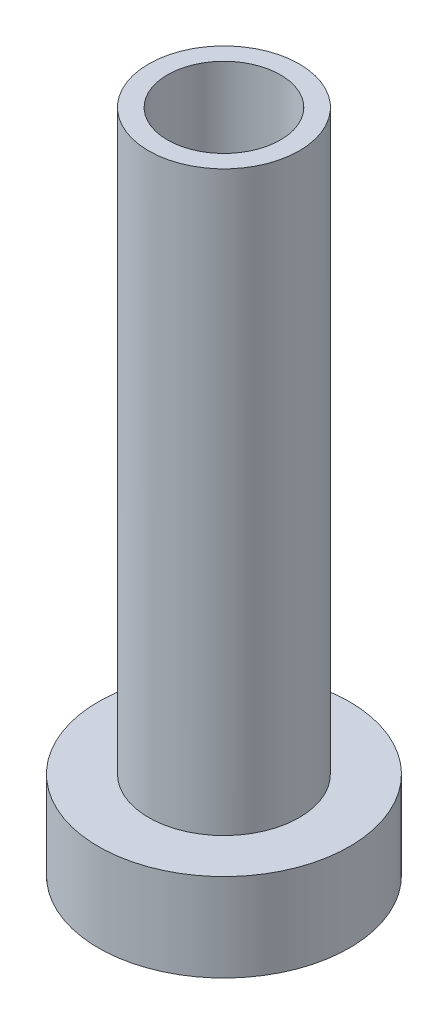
ISO-10303-21;
HEADER;
FILE_DESCRIPTION(('STEP AP214'),'2;1');
FILE_NAME('part.step','',(''),(''),'','','');
FILE_SCHEMA(('AUTOMOTIVE_DESIGN { 1 0 10303 214 1 1 1 1 }'));
ENDSEC;
DATA;
#1=APPLICATION_CONTEXT('core data for automotive mechanical design processes');
#2=APPLICATION_PROTOCOL_DEFINITION('international standard','automotive_design',2000,#1);
#3=PRODUCT_CONTEXT('',#1,'mechanical');
#4=PRODUCT('Part','Part','',(#3));
#5=PRODUCT_RELATED_PRODUCT_CATEGORY('part','',(#4));
#6=PRODUCT_DEFINITION_FORMATION('','',#4);
#7=PRODUCT_DEFINITION_CONTEXT('part definition',#1,'design');
#8=PRODUCT_DEFINITION('design','',#6,#7);
#9=PRODUCT_DEFINITION_SHAPE('','',#8);
#10=(LENGTH_UNIT() NAMED_UNIT(*) SI_UNIT(.MILLI.,.METRE.));
#11=(NAMED_UNIT(*) PLANE_ANGLE_UNIT() SI_UNIT($,.RADIAN.));
#12=(NAMED_UNIT(*) SI_UNIT($,.STERADIAN.) SOLID_ANGLE_UNIT());
#13=UNCERTAINTY_MEASURE_WITH_UNIT(LENGTH_MEASURE(1.E-05),#10,'distance_accuracy_value','');
#14=(GEOMETRIC_REPRESENTATION_CONTEXT(3) GLOBAL_UNCERTAINTY_ASSIGNED_CONTEXT((#13)) GLOBAL_UNIT_ASSIGNED_CONTEXT((#10,
#11,#12)) REPRESENTATION_CONTEXT('',''));
#15=CARTESIAN_POINT('',(0.,0.,0.));
#16=DIRECTION('',(0.,0.,1.));
#17=DIRECTION('',(1.,0.,0.));
#18=AXIS2_PLACEMENT_3D('',#15,#16,#17);
#19=CARTESIAN_POINT('',(0.,0.,0.));
#20=DIRECTION('',(0.,-1.,0.));
#21=DIRECTION('',(0.,0.,-1.));
#22=AXIS2_PLACEMENT_3D('',#19,#20,#21);
#23=CYLINDRICAL_SURFACE('',#22,6.);
#24=CARTESIAN_POINT('',(0.,7.,0.));
#25=DIRECTION('',(0.,-1.,0.));
#26=DIRECTION('',(0.,0.,-1.));
#27=AXIS2_PLACEMENT_3D('',#24,#25,#26);
#28=CIRCLE('',#27,6.);
#29=CARTESIAN_POINT('',(0.,7.,-6.));
#30=VERTEX_POINT('',#29);
#31=EDGE_CURVE('E59',#30,#30,#28,.T.);
#32=ORIENTED_EDGE('',*,*,#31,.F.);
#33=EDGE_LOOP('',(#32));
#34=FACE_BOUND('',#33,.T.);
#35=CARTESIAN_POINT('',(0.,53.,0.));
#36=DIRECTION('',(0.,1.,0.));
#37=DIRECTION('',(0.,0.,1.));
#38=AXIS2_PLACEMENT_3D('',#35,#36,#37);
#39=CIRCLE('',#38,6.);
#40=CARTESIAN_POINT('',(0.,53.,6.));
#41=VERTEX_POINT('',#40);
#42=EDGE_CURVE('E70',#41,#41,#39,.T.);
#43=ORIENTED_EDGE('',*,*,#42,.F.);
#44=EDGE_LOOP('',(#43));
#45=FACE_BOUND('',#44,.T.);
#46=ADVANCED_FACE('F44',(#34,#45),#23,.T.);
#47=CARTESIAN_POINT('',(-3.99999999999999,0.,0.));
#48=DIRECTION('',(0.,1.,0.));
#49=DIRECTION('',(0.,0.,1.));
#50=AXIS2_PLACEMENT_3D('',#47,#48,#49);
#51=PLANE('',#50);
#52=CARTESIAN_POINT('',(0.,0.,0.));
#53=DIRECTION('',(0.,1.,0.));
#54=DIRECTION('',(0.,0.,1.));
#55=AXIS2_PLACEMENT_3D('',#52,#53,#54);
#56=CIRCLE('',#55,5.75000000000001);
#57=CARTESIAN_POINT('',(0.,0.,5.75000000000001));
#58=VERTEX_POINT('',#57);
#59=EDGE_CURVE('E51',#58,#58,#56,.T.);
#60=ORIENTED_EDGE('',*,*,#59,.T.);
#61=EDGE_LOOP('',(#60));
#62=FACE_BOUND('',#61,.T.);
#63=CARTESIAN_POINT('',(0.,0.,0.));
#64=DIRECTION('',(0.,-1.,0.));
#65=DIRECTION('',(0.,0.,-1.));
#66=AXIS2_PLACEMENT_3D('',#63,#64,#65);
#67=CIRCLE('',#66,9.99999999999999);
#68=CARTESIAN_POINT('',(0.,0.,-9.99999999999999));
#69=VERTEX_POINT('',#68);
#70=EDGE_CURVE('E64',#69,#69,#67,.T.);
#71=ORIENTED_EDGE('',*,*,#70,.T.);
#72=EDGE_LOOP('',(#71));
#73=FACE_BOUND('',#72,.T.);
#74=ADVANCED_FACE('F90',(#62,#73),#51,.F.);
#75=CARTESIAN_POINT('',(0.,0.,0.));
#76=DIRECTION('',(0.,-1.,0.));
#77=DIRECTION('',(0.,0.,-1.));
#78=AXIS2_PLACEMENT_3D('',#75,#76,#77);
#79=CYLINDRICAL_SURFACE('',#78,10.);
#80=ORIENTED_EDGE('',*,*,#70,.F.);
#81=EDGE_LOOP('',(#80));
#82=FACE_BOUND('',#81,.T.);
#83=CARTESIAN_POINT('',(0.,7.,0.));
#84=DIRECTION('',(0.,-1.,0.));
#85=DIRECTION('',(0.,0.,-1.));
#86=AXIS2_PLACEMENT_3D('',#83,#84,#85);
#87=CIRCLE('',#86,10.);
#88=CARTESIAN_POINT('',(0.,7.,-10.));
#89=VERTEX_POINT('',#88);
#90=EDGE_CURVE('E55',#89,#89,#87,.T.);
#91=ORIENTED_EDGE('',*,*,#90,.T.);
#92=EDGE_LOOP('',(#91));
#93=FACE_BOUND('',#92,.T.);
#94=ADVANCED_FACE('F96',(#82,#93),#79,.T.);
#95=CARTESIAN_POINT('',(-10.,7.,0.));
#96=DIRECTION('',(0.,-1.,0.));
#97=DIRECTION('',(0.,0.,-1.));
#98=AXIS2_PLACEMENT_3D('',#95,#96,#97);
#99=PLANE('',#98);
#100=ORIENTED_EDGE('',*,*,#90,.F.);
#101=EDGE_LOOP('',(#100));
#102=FACE_BOUND('',#101,.T.);
#103=ORIENTED_EDGE('',*,*,#31,.T.);
#104=EDGE_LOOP('',(#103));
#105=FACE_BOUND('',#104,.T.);
#106=ADVANCED_FACE('F101',(#102,#105),#99,.F.);
#107=CARTESIAN_POINT('',(0.,40.,0.));
#108=DIRECTION('',(0.,1.,0.));
#109=DIRECTION('',(0.,0.,1.));
#110=AXIS2_PLACEMENT_3D('',#107,#108,#109);
#111=PLANE('',#110);
#112=CARTESIAN_POINT('',(0.,40.,0.));
#113=DIRECTION('',(0.,1.,0.));
#114=DIRECTION('',(0.,0.,1.));
#115=AXIS2_PLACEMENT_3D('',#112,#113,#114);
#116=CIRCLE('',#115,4.49999999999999);
#117=CARTESIAN_POINT('',(0.,40.,4.49999999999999));
#118=VERTEX_POINT('',#117);
#119=EDGE_CURVE('E73',#118,#118,#116,.T.);
#120=ORIENTED_EDGE('',*,*,#119,.T.);
#121=EDGE_LOOP('',(#120));
#122=FACE_BOUND('',#121,.T.);
#123=CARTESIAN_POINT('',(0.,40.,0.));
#124=DIRECTION('',(0.,1.,0.));
#125=DIRECTION('',(0.,0.,1.));
#126=AXIS2_PLACEMENT_3D('',#123,#124,#125);
#127=CIRCLE('',#126,4.75);
#128=CARTESIAN_POINT('',(0.,40.,4.75));
#129=VERTEX_POINT('',#128);
#130=EDGE_CURVE('E67',#129,#129,#127,.T.);
#131=ORIENTED_EDGE('',*,*,#130,.F.);
#132=EDGE_LOOP('',(#131));
#133=FACE_BOUND('',#132,.T.);
#134=ADVANCED_FACE('F103',(#122,#133),#111,.F.);
#135=CARTESIAN_POINT('',(0.,40.,0.));
#136=DIRECTION('',(0.,-1.,0.));
#137=DIRECTION('',(0.,0.,-1.));
#138=AXIS2_PLACEMENT_3D('',#135,#136,#137);
#139=CYLINDRICAL_SURFACE('',#138,4.75);
#140=CARTESIAN_POINT('',(0.,1.00000000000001,0.));
#141=DIRECTION('',(0.,1.,0.));
#142=DIRECTION('',(0.,0.,1.));
#143=AXIS2_PLACEMENT_3D('',#140,#141,#142);
#144=CIRCLE('',#143,4.75);
#145=CARTESIAN_POINT('',(0.,1.00000000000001,4.75));
#146=VERTEX_POINT('',#145);
#147=EDGE_CURVE('E12',#146,#146,#144,.F.);
#148=ORIENTED_EDGE('',*,*,#147,.T.);
#149=EDGE_LOOP('',(#148));
#150=FACE_BOUND('',#149,.T.);
#151=ORIENTED_EDGE('',*,*,#130,.T.);
#152=EDGE_LOOP('',(#151));
#153=FACE_BOUND('',#152,.T.);
#154=ADVANCED_FACE('F126',(#150,#153),#139,.F.);
#155=CARTESIAN_POINT('',(0.,0.,0.));
#156=DIRECTION('',(0.,-1.,0.));
#157=DIRECTION('',(0.,0.,-1.));
#158=AXIS2_PLACEMENT_3D('',#155,#156,#157);
#159=CONICAL_SURFACE('',#158,5.75000000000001,0.785398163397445);
#160=ORIENTED_EDGE('',*,*,#147,.F.);
#161=EDGE_LOOP('',(#160));
#162=FACE_BOUND('',#161,.T.);
#163=ORIENTED_EDGE('',*,*,#59,.F.);
#164=EDGE_LOOP('',(#163));
#165=FACE_BOUND('',#164,.T.);
#166=ADVANCED_FACE('F46',(#162,#165),#159,.F.);
#167=CARTESIAN_POINT('',(0.,53.,0.));
#168=DIRECTION('',(0.,1.,0.));
#169=DIRECTION('',(0.,0.,1.));
#170=AXIS2_PLACEMENT_3D('',#167,#168,#169);
#171=PLANE('',#170);
#172=CARTESIAN_POINT('',(0.,53.,0.));
#173=DIRECTION('',(0.,1.,0.));
#174=DIRECTION('',(0.,0.,1.));
#175=AXIS2_PLACEMENT_3D('',#172,#173,#174);
#176=CIRCLE('',#175,4.49999999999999);
#177=CARTESIAN_POINT('',(0.,53.,4.49999999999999));
#178=VERTEX_POINT('',#177);
#179=EDGE_CURVE('E76',#178,#178,#176,.T.);
#180=ORIENTED_EDGE('',*,*,#179,.F.);
#181=EDGE_LOOP('',(#180));
#182=FACE_BOUND('',#181,.T.);
#183=ORIENTED_EDGE('',*,*,#42,.T.);
#184=EDGE_LOOP('',(#183));
#185=FACE_BOUND('',#184,.T.);
#186=ADVANCED_FACE('F83',(#182,#185),#171,.T.);
#187=CARTESIAN_POINT('',(0.,23.,0.));
#188=DIRECTION('',(0.,1.,0.));
#189=DIRECTION('',(0.,0.,1.));
#190=AXIS2_PLACEMENT_3D('',#187,#188,#189);
#191=CYLINDRICAL_SURFACE('',#190,4.49999999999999);
#192=ORIENTED_EDGE('',*,*,#179,.T.);
#193=EDGE_LOOP('',(#192));
#194=FACE_BOUND('',#193,.T.);
#195=ORIENTED_EDGE('',*,*,#119,.F.);
#196=EDGE_LOOP('',(#195));
#197=FACE_BOUND('',#196,.T.);
#198=ADVANCED_FACE('F80',(#194,#197),#191,.F.);
#199=CLOSED_SHELL('',(#46,#74,#94,#106,#134,#154,#166,#186,#198));
#200=MANIFOLD_SOLID_BREP('B2',#199);
#201=ADVANCED_BREP_SHAPE_REPRESENTATION('',(#18,#200),#14);
#202=SHAPE_DEFINITION_REPRESENTATION(#9,#201);
ENDSEC;
END-ISO-10303-21;
